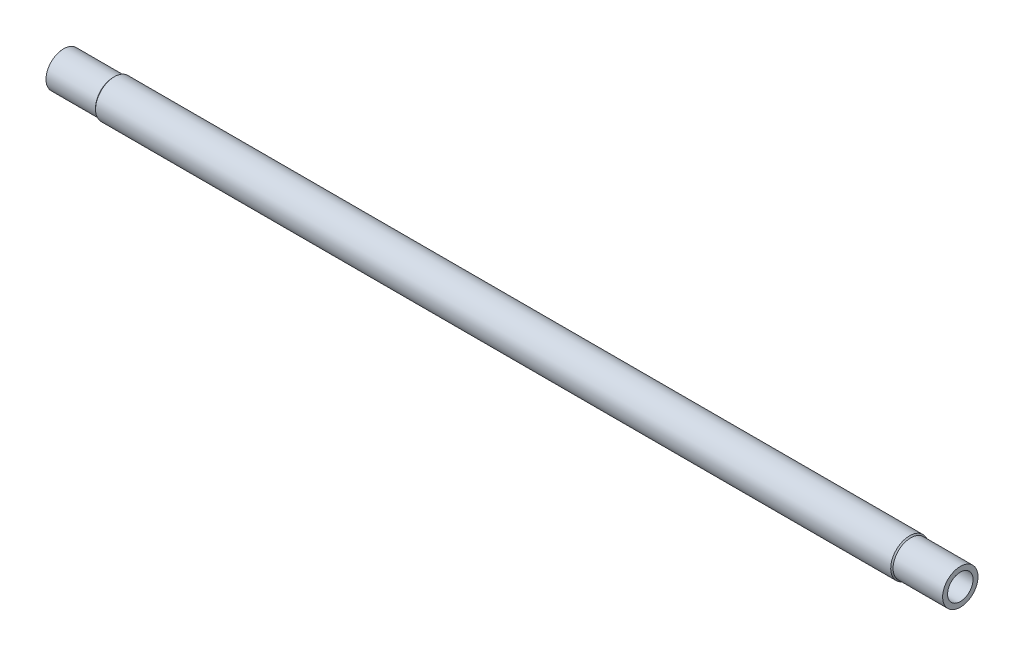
ISO-10303-21;
HEADER;
FILE_DESCRIPTION(('STEP AP214'),'2;1');
FILE_NAME('part.step','',(''),(''),'','','');
FILE_SCHEMA(('AUTOMOTIVE_DESIGN { 1 0 10303 214 1 1 1 1 }'));
ENDSEC;
DATA;
#1=APPLICATION_CONTEXT('core data for automotive mechanical design processes');
#2=APPLICATION_PROTOCOL_DEFINITION('international standard','automotive_design',2000,#1);
#3=PRODUCT_CONTEXT('',#1,'mechanical');
#4=PRODUCT('Part','Part','',(#3));
#5=PRODUCT_RELATED_PRODUCT_CATEGORY('part','',(#4));
#6=PRODUCT_DEFINITION_FORMATION('','',#4);
#7=PRODUCT_DEFINITION_CONTEXT('part definition',#1,'design');
#8=PRODUCT_DEFINITION('design','',#6,#7);
#9=PRODUCT_DEFINITION_SHAPE('','',#8);
#10=(LENGTH_UNIT() NAMED_UNIT(*) SI_UNIT(.MILLI.,.METRE.));
#11=(NAMED_UNIT(*) PLANE_ANGLE_UNIT() SI_UNIT($,.RADIAN.));
#12=(NAMED_UNIT(*) SI_UNIT($,.STERADIAN.) SOLID_ANGLE_UNIT());
#13=UNCERTAINTY_MEASURE_WITH_UNIT(LENGTH_MEASURE(1.E-05),#10,'distance_accuracy_value','');
#14=(GEOMETRIC_REPRESENTATION_CONTEXT(3) GLOBAL_UNCERTAINTY_ASSIGNED_CONTEXT((#13)) GLOBAL_UNIT_ASSIGNED_CONTEXT((#10,
#11,#12)) REPRESENTATION_CONTEXT('',''));
#15=CARTESIAN_POINT('',(0.,0.,0.));
#16=DIRECTION('',(0.,0.,1.));
#17=DIRECTION('',(1.,0.,0.));
#18=AXIS2_PLACEMENT_3D('',#15,#16,#17);
#19=CARTESIAN_POINT('',(424.930257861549,-18.9655176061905,0.));
#20=DIRECTION('',(1.,0.,0.));
#21=DIRECTION('',(0.,1.,0.));
#22=AXIS2_PLACEMENT_3D('',#19,#20,#21);
#23=CYLINDRICAL_SURFACE('',#22,25.);
#24=CARTESIAN_POINT('',(-7.56974213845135,-18.9655176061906,0.));
#25=DIRECTION('',(1.,0.,0.));
#26=DIRECTION('',(0.,1.,0.));
#27=AXIS2_PLACEMENT_3D('',#24,#25,#26);
#28=CIRCLE('',#27,25.);
#29=CARTESIAN_POINT('',(-7.56974213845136,6.03448239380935,0.));
#30=VERTEX_POINT('',#29);
#31=EDGE_CURVE('E52',#30,#30,#28,.T.);
#32=ORIENTED_EDGE('',*,*,#31,.F.);
#33=EDGE_LOOP('',(#32));
#34=FACE_BOUND('',#33,.T.);
#35=CARTESIAN_POINT('',(1722.43025786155,-18.9655176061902,0.));
#36=DIRECTION('',(1.,0.,0.));
#37=DIRECTION('',(0.,1.,0.));
#38=AXIS2_PLACEMENT_3D('',#35,#36,#37);
#39=CIRCLE('',#38,25.);
#40=CARTESIAN_POINT('',(1722.43025786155,6.03448239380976,0.));
#41=VERTEX_POINT('',#40);
#42=EDGE_CURVE('E18',#41,#41,#39,.F.);
#43=ORIENTED_EDGE('',*,*,#42,.F.);
#44=EDGE_LOOP('',(#43));
#45=FACE_BOUND('',#44,.T.);
#46=ADVANCED_FACE('F14',(#34,#45),#23,.F.);
#47=CARTESIAN_POINT('',(1722.43025786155,7.0344823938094,0.));
#48=DIRECTION('',(1.,0.,0.));
#49=DIRECTION('',(0.,0.,-1.));
#50=AXIS2_PLACEMENT_3D('',#47,#48,#49);
#51=PLANE('',#50);
#52=ORIENTED_EDGE('',*,*,#42,.T.);
#53=EDGE_LOOP('',(#52));
#54=FACE_BOUND('',#53,.T.);
#55=CARTESIAN_POINT('',(1722.43025786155,-18.9655176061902,0.));
#56=DIRECTION('',(1.,0.,0.));
#57=DIRECTION('',(0.,1.,0.));
#58=AXIS2_PLACEMENT_3D('',#55,#56,#57);
#59=CIRCLE('',#58,26.9999999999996);
#60=CARTESIAN_POINT('',(1722.43025786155,8.03448239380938,0.));
#61=VERTEX_POINT('',#60);
#62=EDGE_CURVE('E50',#61,#61,#59,.T.);
#63=ORIENTED_EDGE('',*,*,#62,.T.);
#64=EDGE_LOOP('',(#63));
#65=FACE_BOUND('',#64,.T.);
#66=ADVANCED_FACE('F59',(#54,#65),#51,.T.);
#67=CARTESIAN_POINT('',(-7.56974213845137,7.0344823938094,0.));
#68=DIRECTION('',(-1.,0.,0.));
#69=DIRECTION('',(0.,0.,1.));
#70=AXIS2_PLACEMENT_3D('',#67,#68,#69);
#71=PLANE('',#70);
#72=ORIENTED_EDGE('',*,*,#31,.T.);
#73=EDGE_LOOP('',(#72));
#74=FACE_BOUND('',#73,.T.);
#75=CARTESIAN_POINT('',(-7.56974213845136,-18.9655176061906,0.));
#76=DIRECTION('',(1.,0.,0.));
#77=DIRECTION('',(0.,1.,0.));
#78=AXIS2_PLACEMENT_3D('',#75,#76,#77);
#79=CIRCLE('',#78,27.);
#80=CARTESIAN_POINT('',(-7.56974213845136,8.0344823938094,0.));
#81=VERTEX_POINT('',#80);
#82=EDGE_CURVE('E47',#81,#81,#79,.F.);
#83=ORIENTED_EDGE('',*,*,#82,.T.);
#84=EDGE_LOOP('',(#83));
#85=FACE_BOUND('',#84,.T.);
#86=ADVANCED_FACE('F68',(#74,#85),#71,.T.);
#87=CARTESIAN_POINT('',(1764.93025786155,-18.9655176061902,0.));
#88=DIRECTION('',(1.,0.,0.));
#89=DIRECTION('',(0.,1.,0.));
#90=AXIS2_PLACEMENT_3D('',#87,#88,#89);
#91=CYLINDRICAL_SURFACE('',#90,26.9999999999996);
#92=ORIENTED_EDGE('',*,*,#62,.F.);
#93=EDGE_LOOP('',(#92));
#94=FACE_BOUND('',#93,.T.);
#95=CARTESIAN_POINT('',(1807.43025786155,-18.9655176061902,0.));
#96=DIRECTION('',(1.,0.,0.));
#97=DIRECTION('',(0.,1.,0.));
#98=AXIS2_PLACEMENT_3D('',#95,#96,#97);
#99=CIRCLE('',#98,26.9999999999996);
#100=CARTESIAN_POINT('',(1807.43025786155,8.0344823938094,0.));
#101=VERTEX_POINT('',#100);
#102=EDGE_CURVE('E44',#101,#101,#99,.F.);
#103=ORIENTED_EDGE('',*,*,#102,.F.);
#104=EDGE_LOOP('',(#103));
#105=FACE_BOUND('',#104,.T.);
#106=ADVANCED_FACE('F103',(#94,#105),#91,.F.);
#107=CARTESIAN_POINT('',(-50.0697421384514,-18.9655176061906,0.));
#108=DIRECTION('',(1.,0.,0.));
#109=DIRECTION('',(0.,1.,0.));
#110=AXIS2_PLACEMENT_3D('',#107,#108,#109);
#111=CYLINDRICAL_SURFACE('',#110,27.);
#112=CARTESIAN_POINT('',(-92.5697421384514,-18.9655176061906,0.));
#113=DIRECTION('',(1.,0.,0.));
#114=DIRECTION('',(0.,1.,0.));
#115=AXIS2_PLACEMENT_3D('',#112,#113,#114);
#116=CIRCLE('',#115,27.);
#117=CARTESIAN_POINT('',(-92.5697421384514,8.03448239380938,0.));
#118=VERTEX_POINT('',#117);
#119=EDGE_CURVE('E41',#118,#118,#116,.T.);
#120=ORIENTED_EDGE('',*,*,#119,.F.);
#121=EDGE_LOOP('',(#120));
#122=FACE_BOUND('',#121,.T.);
#123=ORIENTED_EDGE('',*,*,#82,.F.);
#124=EDGE_LOOP('',(#123));
#125=FACE_BOUND('',#124,.T.);
#126=ADVANCED_FACE('F99',(#122,#125),#111,.F.);
#127=CARTESIAN_POINT('',(1807.43025786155,13.2844823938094,0.));
#128=DIRECTION('',(1.,0.,0.));
#129=DIRECTION('',(0.,0.,-1.));
#130=AXIS2_PLACEMENT_3D('',#127,#128,#129);
#131=PLANE('',#130);
#132=ORIENTED_EDGE('',*,*,#102,.T.);
#133=EDGE_LOOP('',(#132));
#134=FACE_BOUND('',#133,.T.);
#135=CARTESIAN_POINT('',(1807.43025786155,-18.9655176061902,0.));
#136=DIRECTION('',(1.,0.,0.));
#137=DIRECTION('',(0.,1.,0.));
#138=AXIS2_PLACEMENT_3D('',#135,#136,#137);
#139=CIRCLE('',#138,37.4999999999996);
#140=CARTESIAN_POINT('',(1807.43025786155,18.5344823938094,0.));
#141=VERTEX_POINT('',#140);
#142=EDGE_CURVE('E38',#141,#141,#139,.F.);
#143=ORIENTED_EDGE('',*,*,#142,.F.);
#144=EDGE_LOOP('',(#143));
#145=FACE_BOUND('',#144,.T.);
#146=ADVANCED_FACE('F95',(#134,#145),#131,.T.);
#147=CARTESIAN_POINT('',(-92.5697421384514,13.2844823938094,0.));
#148=DIRECTION('',(-1.,0.,0.));
#149=DIRECTION('',(0.,0.,1.));
#150=AXIS2_PLACEMENT_3D('',#147,#148,#149);
#151=PLANE('',#150);
#152=ORIENTED_EDGE('',*,*,#119,.T.);
#153=EDGE_LOOP('',(#152));
#154=FACE_BOUND('',#153,.T.);
#155=CARTESIAN_POINT('',(-92.5697421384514,-18.9655176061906,0.));
#156=DIRECTION('',(1.,0.,0.));
#157=DIRECTION('',(0.,1.,0.));
#158=AXIS2_PLACEMENT_3D('',#155,#156,#157);
#159=CIRCLE('',#158,37.5);
#160=CARTESIAN_POINT('',(-92.5697421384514,18.5344823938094,0.));
#161=VERTEX_POINT('',#160);
#162=EDGE_CURVE('E35',#161,#161,#159,.T.);
#163=ORIENTED_EDGE('',*,*,#162,.F.);
#164=EDGE_LOOP('',(#163));
#165=FACE_BOUND('',#164,.T.);
#166=ADVANCED_FACE('F91',(#154,#165),#151,.T.);
#167=CARTESIAN_POINT('',(1754.93025786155,-18.9655176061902,0.));
#168=DIRECTION('',(1.,0.,0.));
#169=DIRECTION('',(0.,1.,0.));
#170=AXIS2_PLACEMENT_3D('',#167,#168,#169);
#171=CYLINDRICAL_SURFACE('',#170,37.4999999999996);
#172=ORIENTED_EDGE('',*,*,#142,.T.);
#173=EDGE_LOOP('',(#172));
#174=FACE_BOUND('',#173,.T.);
#175=CARTESIAN_POINT('',(1702.43025786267,-18.9655176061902,0.));
#176=DIRECTION('',(-1.,0.,0.));
#177=DIRECTION('',(0.,1.,0.));
#178=AXIS2_PLACEMENT_3D('',#175,#176,#177);
#179=CIRCLE('',#178,37.5000000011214);
#180=CARTESIAN_POINT('',(1702.43025786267,18.5344823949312,0.));
#181=VERTEX_POINT('',#180);
#182=EDGE_CURVE('E32',#181,#181,#179,.T.);
#183=ORIENTED_EDGE('',*,*,#182,.F.);
#184=EDGE_LOOP('',(#183));
#185=FACE_BOUND('',#184,.T.);
#186=ADVANCED_FACE('F85',(#174,#185),#171,.T.);
#187=CARTESIAN_POINT('',(-40.0697421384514,-18.9655176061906,0.));
#188=DIRECTION('',(1.,0.,0.));
#189=DIRECTION('',(0.,1.,0.));
#190=AXIS2_PLACEMENT_3D('',#187,#188,#189);
#191=CYLINDRICAL_SURFACE('',#190,37.5);
#192=CARTESIAN_POINT('',(12.4302578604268,-18.9655176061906,0.));
#193=DIRECTION('',(1.,0.,0.));
#194=DIRECTION('',(0.,1.,0.));
#195=AXIS2_PLACEMENT_3D('',#192,#193,#194);
#196=CIRCLE('',#195,37.5000000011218);
#197=CARTESIAN_POINT('',(12.4302578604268,18.5344823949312,0.));
#198=VERTEX_POINT('',#197);
#199=EDGE_CURVE('E27',#198,#198,#196,.T.);
#200=ORIENTED_EDGE('',*,*,#199,.F.);
#201=EDGE_LOOP('',(#200));
#202=FACE_BOUND('',#201,.T.);
#203=ORIENTED_EDGE('',*,*,#162,.T.);
#204=EDGE_LOOP('',(#203));
#205=FACE_BOUND('',#204,.T.);
#206=ADVANCED_FACE('F80',(#202,#205),#191,.T.);
#207=CARTESIAN_POINT('',(1699.93025786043,-18.9655176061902,0.));
#208=DIRECTION('',(-1.,0.,0.));
#209=DIRECTION('',(0.,0.,1.));
#210=AXIS2_PLACEMENT_3D('',#207,#208,#209);
#211=CONICAL_SURFACE('',#210,39.9999999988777,0.785398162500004);
#212=ORIENTED_EDGE('',*,*,#182,.T.);
#213=EDGE_LOOP('',(#212));
#214=FACE_BOUND('',#213,.T.);
#215=CARTESIAN_POINT('',(1699.93025786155,-18.9655176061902,0.));
#216=DIRECTION('',(1.,0.,0.));
#217=DIRECTION('',(0.,1.,0.));
#218=AXIS2_PLACEMENT_3D('',#215,#216,#217);
#219=CIRCLE('',#218,39.9999999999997);
#220=CARTESIAN_POINT('',(1699.93025786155,21.0344823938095,0.));
#221=VERTEX_POINT('',#220);
#222=EDGE_CURVE('E22',#221,#221,#219,.F.);
#223=ORIENTED_EDGE('',*,*,#222,.F.);
#224=EDGE_LOOP('',(#223));
#225=FACE_BOUND('',#224,.T.);
#226=ADVANCED_FACE('F75',(#214,#225),#211,.T.);
#227=CARTESIAN_POINT('',(14.9302578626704,-18.9655176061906,0.));
#228=DIRECTION('',(1.,0.,0.));
#229=DIRECTION('',(0.,1.,0.));
#230=AXIS2_PLACEMENT_3D('',#227,#228,#229);
#231=CONICAL_SURFACE('',#230,39.9999999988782,0.785398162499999);
#232=CARTESIAN_POINT('',(14.9302578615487,-18.9655176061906,0.));
#233=DIRECTION('',(1.,0.,0.));
#234=DIRECTION('',(0.,1.,0.));
#235=AXIS2_PLACEMENT_3D('',#232,#233,#234);
#236=CIRCLE('',#235,39.9999999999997);
#237=CARTESIAN_POINT('',(14.9302578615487,21.0344823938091,0.));
#238=VERTEX_POINT('',#237);
#239=EDGE_CURVE('E9',#238,#238,#236,.T.);
#240=ORIENTED_EDGE('',*,*,#239,.F.);
#241=EDGE_LOOP('',(#240));
#242=FACE_BOUND('',#241,.T.);
#243=ORIENTED_EDGE('',*,*,#199,.T.);
#244=EDGE_LOOP('',(#243));
#245=FACE_BOUND('',#244,.T.);
#246=ADVANCED_FACE('F71',(#242,#245),#231,.T.);
#247=CARTESIAN_POINT('',(1278.68025786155,-18.9655176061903,0.));
#248=DIRECTION('',(1.,0.,0.));
#249=DIRECTION('',(0.,1.,0.));
#250=AXIS2_PLACEMENT_3D('',#247,#248,#249);
#251=CYLINDRICAL_SURFACE('',#250,39.9999999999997);
#252=ORIENTED_EDGE('',*,*,#222,.T.);
#253=EDGE_LOOP('',(#252));
#254=FACE_BOUND('',#253,.T.);
#255=ORIENTED_EDGE('',*,*,#239,.T.);
#256=EDGE_LOOP('',(#255));
#257=FACE_BOUND('',#256,.T.);
#258=ADVANCED_FACE('F16',(#254,#257),#251,.T.);
#259=CLOSED_SHELL('',(#46,#66,#86,#106,#126,#146,#166,#186,#206,#226,#246,#258));
#260=MANIFOLD_SOLID_BREP('B1',#259);
#261=ADVANCED_BREP_SHAPE_REPRESENTATION('',(#18,#260),#14);
#262=SHAPE_DEFINITION_REPRESENTATION(#9,#261);
ENDSEC;
END-ISO-10303-21;
